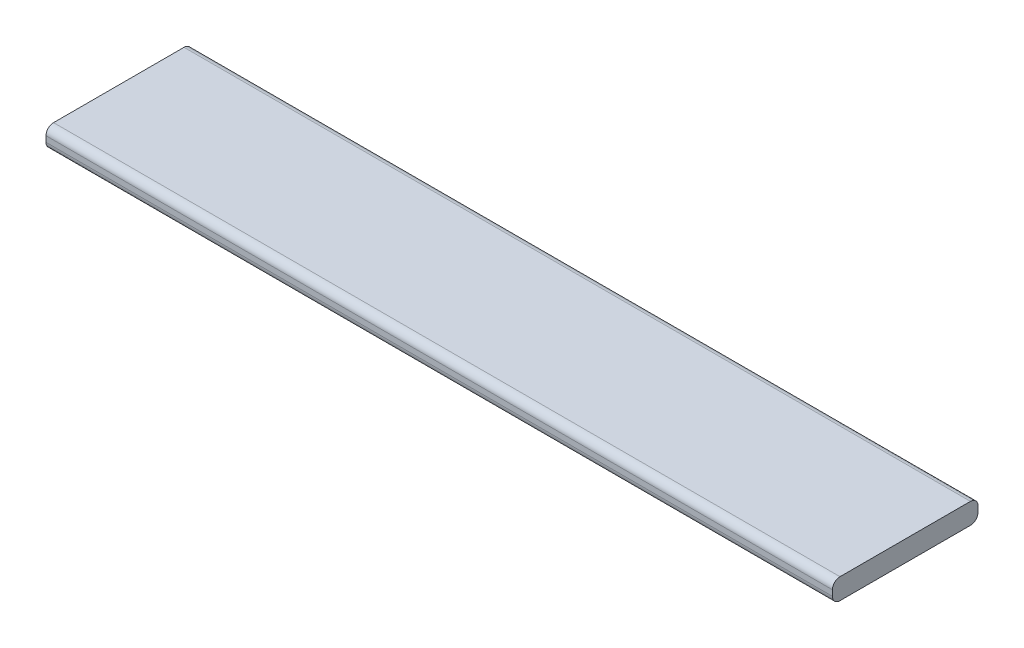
from build123d import *

# Parameters (mm, degrees)
SKETCH2_W           = 122.2375
SKETCH2_H           = 17.4625
BOSS_EXTRUDE1_DEPTH = 660.4
FILLET1_R           = 6.35


with BuildPart() as part:
    # Sketch2 → Boss-Extrude1 (new body)
    with BuildSketch(Plane(origin=(0, 0, 0), x_dir=(0, 0, -1), z_dir=(1, 0, 0))):
        with Locations((-61.11875, 8.73125)):
            Rectangle(SKETCH2_W, SKETCH2_H)
    extrude(amount=BOSS_EXTRUDE1_DEPTH)

    # Fillet1
    fillet1_edges = [part.edges().sort_by_distance(p)[0] for p in [
        (330.2, 17.4625, 122.2375),
        (330.2, 0, 122.2375),
        (330.2, 0, 0),
        (330.2, 17.4625, 0),
    ]]
    fillet(fillet1_edges, radius=FILLET1_R)


solid = part.part
